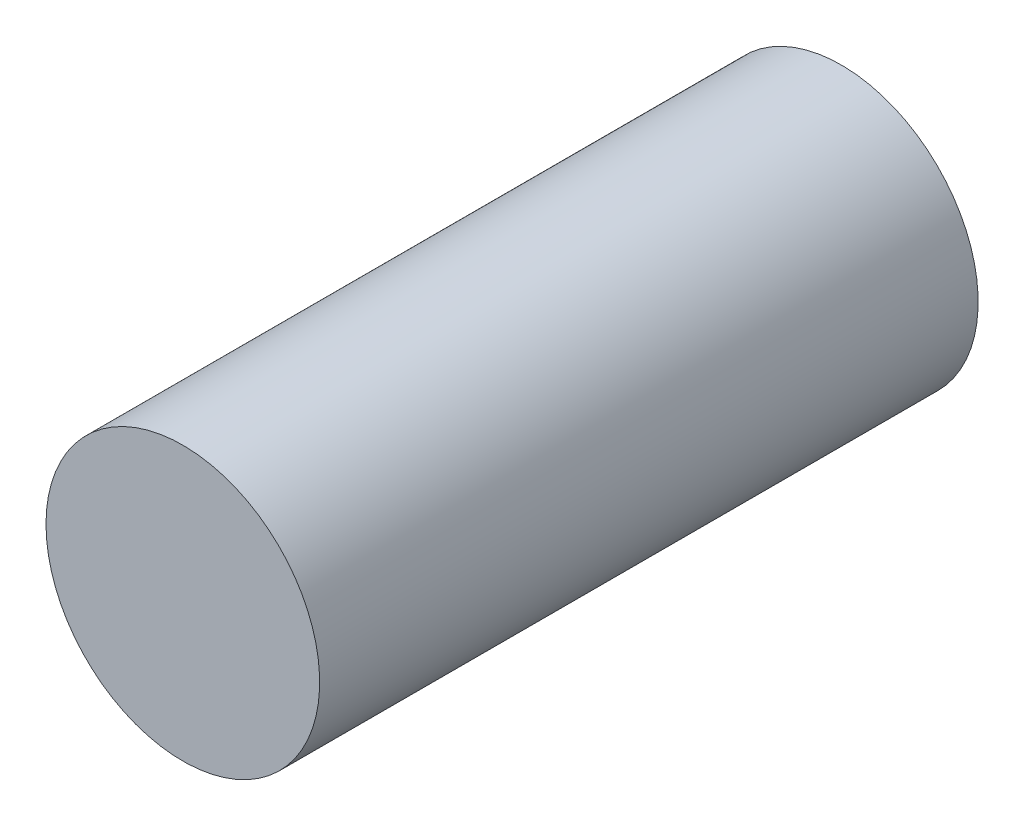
from build123d import *

# Parameters (mm, degrees)
ESQUISSE1_R      = 0.8
EXTRUSION1_DEPTH = 3.85


with BuildPart() as part:
    # Esquisse1 → Extrusion1 (new body)
    with BuildSketch(Plane.XY):
        with Locations(Location((0, 0, 0), (0, 0, 180))):
            Circle(ESQUISSE1_R)
    extrude(amount=EXTRUSION1_DEPTH)


solid = part.part
